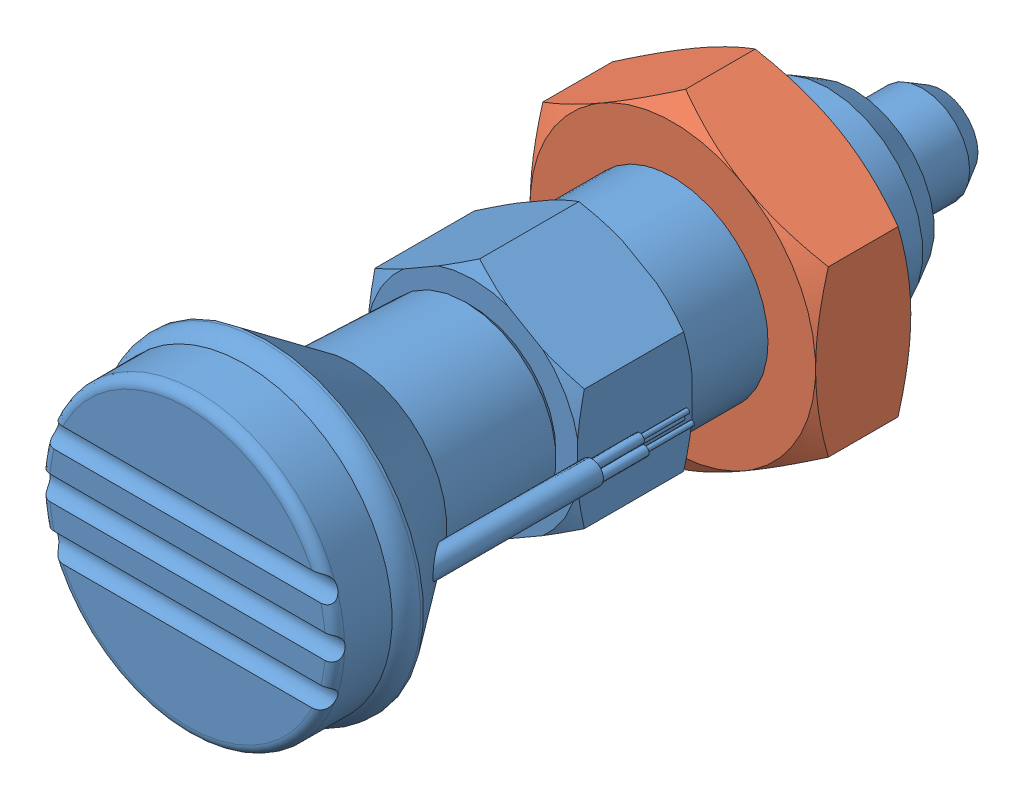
SolidWorks assembly NDX20W-S.sldasm, configuration Default (file format 15000). Lengths in mm.
Overall size (40.99 40.99 80).
2 component instances, 2 part files, 0 mates.
Components (placement in the parent):
- NDX20W-S_01-1: NDX20W-S_01.sldprt [ﾃﾞﾌｫﾙﾄ] at origin size (33 33 80)
- NDX20W-S_02-1: NDX20W-S_02.sldprt [ﾃﾞﾌｫﾙﾄ] at origin size (40.99 40.99 10.01)
